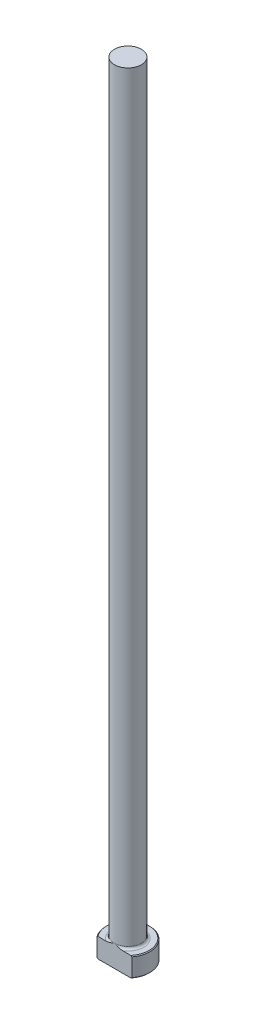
ISO-10303-21;
HEADER;
FILE_DESCRIPTION(('STEP AP214'),'2;1');
FILE_NAME('part.step','',(''),(''),'','','');
FILE_SCHEMA(('AUTOMOTIVE_DESIGN { 1 0 10303 214 1 1 1 1 }'));
ENDSEC;
DATA;
#1=APPLICATION_CONTEXT('core data for automotive mechanical design processes');
#2=APPLICATION_PROTOCOL_DEFINITION('international standard','automotive_design',2000,#1);
#3=PRODUCT_CONTEXT('',#1,'mechanical');
#4=PRODUCT('Part','Part','',(#3));
#5=PRODUCT_RELATED_PRODUCT_CATEGORY('part','',(#4));
#6=PRODUCT_DEFINITION_FORMATION('','',#4);
#7=PRODUCT_DEFINITION_CONTEXT('part definition',#1,'design');
#8=PRODUCT_DEFINITION('design','',#6,#7);
#9=PRODUCT_DEFINITION_SHAPE('','',#8);
#10=(LENGTH_UNIT() NAMED_UNIT(*) SI_UNIT(.MILLI.,.METRE.));
#11=(NAMED_UNIT(*) PLANE_ANGLE_UNIT() SI_UNIT($,.RADIAN.));
#12=(NAMED_UNIT(*) SI_UNIT($,.STERADIAN.) SOLID_ANGLE_UNIT());
#13=UNCERTAINTY_MEASURE_WITH_UNIT(LENGTH_MEASURE(1.E-05),#10,'distance_accuracy_value','');
#14=(GEOMETRIC_REPRESENTATION_CONTEXT(3) GLOBAL_UNCERTAINTY_ASSIGNED_CONTEXT((#13)) GLOBAL_UNIT_ASSIGNED_CONTEXT((#10,
#11,#12)) REPRESENTATION_CONTEXT('',''));
#15=CARTESIAN_POINT('',(0.,0.,0.));
#16=DIRECTION('',(0.,0.,1.));
#17=DIRECTION('',(1.,0.,0.));
#18=AXIS2_PLACEMENT_3D('',#15,#16,#17);
#19=CARTESIAN_POINT('',(0.,0.,0.));
#20=DIRECTION('',(0.,-1.,0.));
#21=DIRECTION('',(0.,0.,-1.));
#22=AXIS2_PLACEMENT_3D('',#19,#20,#21);
#23=PLANE('',#22);
#24=CARTESIAN_POINT('',(0.,0.,0.));
#25=DIRECTION('',(0.,-1.,0.));
#26=DIRECTION('',(0.,0.,-1.));
#27=AXIS2_PLACEMENT_3D('',#24,#25,#26);
#28=CIRCLE('',#27,6.88339999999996);
#29=CARTESIAN_POINT('',(-5.3224109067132,0.,4.36498999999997));
#30=VERTEX_POINT('',#29);
#31=CARTESIAN_POINT('',(5.3224109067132,0.,4.36498999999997));
#32=VERTEX_POINT('',#31);
#33=EDGE_CURVE('E98',#30,#32,#28,.T.);
#34=ORIENTED_EDGE('',*,*,#33,.T.);
#35=DIRECTION('',(-1.,0.,0.));
#36=VECTOR('',#35,1.);
#37=CARTESIAN_POINT('',(-5.64706481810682,0.,4.36498999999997));
#38=LINE('',#37,#36);
#39=EDGE_CURVE('E83',#32,#30,#38,.T.);
#40=ORIENTED_EDGE('',*,*,#39,.T.);
#41=EDGE_LOOP('',(#34,#40));
#42=FACE_BOUND('',#41,.T.);
#43=ADVANCED_FACE('F32',(#42),#23,.T.);
#44=CARTESIAN_POINT('',(0.,259.958771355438,0.));
#45=DIRECTION('',(0.,1.,0.));
#46=DIRECTION('',(0.,0.,1.));
#47=AXIS2_PLACEMENT_3D('',#44,#45,#46);
#48=CYLINDRICAL_SURFACE('',#47,7.13739999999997);
#49=CARTESIAN_POINT('',(0.,6.09599999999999,0.));
#50=DIRECTION('',(0.,1.,0.));
#51=DIRECTION('',(0.,0.,1.));
#52=AXIS2_PLACEMENT_3D('',#49,#50,#51);
#53=CIRCLE('',#52,7.13739999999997);
#54=CARTESIAN_POINT('',(-5.64706481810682,6.09599999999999,4.36498999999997));
#55=VERTEX_POINT('',#54);
#56=CARTESIAN_POINT('',(5.64706481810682,6.09599999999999,4.36498999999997));
#57=VERTEX_POINT('',#56);
#58=EDGE_CURVE('E104',#55,#57,#53,.F.);
#59=ORIENTED_EDGE('',*,*,#58,.T.);
#60=DIRECTION('',(0.,-1.,0.));
#61=VECTOR('',#60,1.);
#62=CARTESIAN_POINT('',(5.64706481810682,254.,4.36498999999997));
#63=LINE('',#62,#61);
#64=CARTESIAN_POINT('',(5.64706481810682,0.253999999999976,4.36498999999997));
#65=VERTEX_POINT('',#64);
#66=EDGE_CURVE('E183',#57,#65,#63,.T.);
#67=ORIENTED_EDGE('',*,*,#66,.T.);
#68=CARTESIAN_POINT('',(0.,0.253999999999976,0.));
#69=DIRECTION('',(0.,-1.,0.));
#70=DIRECTION('',(0.,0.,-1.));
#71=AXIS2_PLACEMENT_3D('',#68,#69,#70);
#72=CIRCLE('',#71,7.13739999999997);
#73=CARTESIAN_POINT('',(-5.64706481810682,0.253999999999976,4.36498999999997));
#74=VERTEX_POINT('',#73);
#75=EDGE_CURVE('E100',#65,#74,#72,.F.);
#76=ORIENTED_EDGE('',*,*,#75,.T.);
#77=DIRECTION('',(0.,-1.,0.));
#78=VECTOR('',#77,1.);
#79=CARTESIAN_POINT('',(-5.64706481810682,254.,4.36498999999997));
#80=LINE('',#79,#78);
#81=EDGE_CURVE('E93',#55,#74,#80,.T.);
#82=ORIENTED_EDGE('',*,*,#81,.F.);
#83=EDGE_LOOP('',(#59,#67,#76,#82));
#84=FACE_BOUND('',#83,.T.);
#85=ADVANCED_FACE('F158',(#84),#48,.T.);
#86=CARTESIAN_POINT('',(-7.13739999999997,6.35,0.));
#87=DIRECTION('',(0.,1.,0.));
#88=DIRECTION('',(0.,0.,1.));
#89=AXIS2_PLACEMENT_3D('',#86,#87,#88);
#90=PLANE('',#89);
#91=CARTESIAN_POINT('',(0.,6.35,0.));
#92=DIRECTION('',(0.,1.,0.));
#93=DIRECTION('',(0.,0.,1.));
#94=AXIS2_PLACEMENT_3D('',#91,#92,#93);
#95=CIRCLE('',#94,6.88340000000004);
#96=CARTESIAN_POINT('',(5.32241090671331,6.35,4.36498999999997));
#97=VERTEX_POINT('',#96);
#98=CARTESIAN_POINT('',(-5.32241090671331,6.35,4.36498999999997));
#99=VERTEX_POINT('',#98);
#100=EDGE_CURVE('E178',#97,#99,#95,.T.);
#101=ORIENTED_EDGE('',*,*,#100,.T.);
#102=DIRECTION('',(1.,0.,0.));
#103=VECTOR('',#102,1.);
#104=CARTESIAN_POINT('',(-7.13739999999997,6.35,4.36498999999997));
#105=LINE('',#104,#103);
#106=CARTESIAN_POINT('',(-2.68940304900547,6.35000000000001,4.36498999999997));
#107=VERTEX_POINT('',#106);
#108=EDGE_CURVE('E57',#99,#107,#105,.T.);
#109=ORIENTED_EDGE('',*,*,#108,.T.);
#110=CARTESIAN_POINT('',(0.,6.35,0.));
#111=DIRECTION('',(0.,1.,0.));
#112=DIRECTION('',(0.,0.,1.));
#113=AXIS2_PLACEMENT_3D('',#110,#111,#112);
#114=CIRCLE('',#113,5.12698999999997);
#115=CARTESIAN_POINT('',(2.68940304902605,6.35000000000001,4.36498999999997));
#116=VERTEX_POINT('',#115);
#117=EDGE_CURVE('E107',#107,#116,#114,.F.);
#118=ORIENTED_EDGE('',*,*,#117,.T.);
#119=EDGE_CURVE('E136',#116,#97,#105,.T.);
#120=ORIENTED_EDGE('',*,*,#119,.T.);
#121=EDGE_LOOP('',(#101,#109,#118,#120));
#122=FACE_BOUND('',#121,.T.);
#123=ADVANCED_FACE('F147',(#122),#90,.T.);
#124=CARTESIAN_POINT('',(0.,6.35000000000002,0.));
#125=DIRECTION('',(0.,-1.,0.));
#126=DIRECTION('',(0.,0.,-1.));
#127=AXIS2_PLACEMENT_3D('',#124,#125,#126);
#128=CONICAL_SURFACE('',#127,6.88340000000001,0.785398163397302);
#129=ORIENTED_EDGE('',*,*,#58,.F.);
#130=CARTESIAN_POINT('',(-12.4254560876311,0.0635443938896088,4.36498999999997));
#131=CARTESIAN_POINT('',(-12.2264754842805,0.251274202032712,4.36498999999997));
#132=CARTESIAN_POINT('',(-12.027251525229,0.438746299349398,4.36498999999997));
#133=CARTESIAN_POINT('',(-11.6282346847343,0.813086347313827,4.36498999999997));
#134=CARTESIAN_POINT('',(-11.4284417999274,0.999954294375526,4.36498999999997));
#135=CARTESIAN_POINT('',(-10.8277329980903,1.55984821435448,4.36498999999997));
#136=CARTESIAN_POINT('',(-10.4258415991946,1.93182905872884,4.36498999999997));
#137=CARTESIAN_POINT('',(-9.6054098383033,2.68403168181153,4.36498999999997));
#138=CARTESIAN_POINT('',(-9.18675348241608,3.06412737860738,4.36498999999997));
#139=CARTESIAN_POINT('',(-8.5549523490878,3.62966956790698,4.36498999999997));
#140=CARTESIAN_POINT('',(-8.34380112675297,3.81734255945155,4.36498999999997));
#141=CARTESIAN_POINT('',(-7.91988421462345,4.19085479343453,4.36498999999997));
#142=CARTESIAN_POINT('',(-7.70711853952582,4.37669405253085,4.36498999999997));
#143=CARTESIAN_POINT('',(-7.27981523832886,4.74592147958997,4.36498999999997));
#144=CARTESIAN_POINT('',(-7.06527945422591,4.92931177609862,4.36498999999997));
#145=CARTESIAN_POINT('',(-6.63376365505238,5.29321745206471,4.36498999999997));
#146=CARTESIAN_POINT('',(-6.41678354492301,5.47373271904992,4.36498999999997));
#147=CARTESIAN_POINT('',(-5.9791971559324,5.83150772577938,4.36498999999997));
#148=CARTESIAN_POINT('',(-5.75858285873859,6.00875768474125,4.36498999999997));
#149=CARTESIAN_POINT('',(-5.31347514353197,6.35828986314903,4.36498999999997));
#150=CARTESIAN_POINT('',(-5.08898216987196,6.53057264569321,4.36498999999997));
#151=CARTESIAN_POINT('',(-4.6382365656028,6.86598134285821,4.36498999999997));
#152=CARTESIAN_POINT('',(-4.41205572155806,7.02920333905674,4.36498999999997));
#153=CARTESIAN_POINT('',(-3.95321518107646,7.34667825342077,4.36498999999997));
#154=CARTESIAN_POINT('',(-3.72055201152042,7.50092622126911,4.36498999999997));
#155=CARTESIAN_POINT('',(-3.36592178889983,7.72212517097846,4.36498999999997));
#156=CARTESIAN_POINT('',(-3.24703751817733,7.79401703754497,4.36498999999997));
#157=CARTESIAN_POINT('',(-3.00696415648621,7.93383106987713,4.36498999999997));
#158=CARTESIAN_POINT('',(-2.88577534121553,8.00175370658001,4.36498999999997));
#159=CARTESIAN_POINT('',(-2.64094314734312,8.1327102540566,4.36498999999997));
#160=CARTESIAN_POINT('',(-2.51730263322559,8.19574949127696,4.36498999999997));
#161=CARTESIAN_POINT('',(-2.26721111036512,8.31594515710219,4.36498999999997));
#162=CARTESIAN_POINT('',(-2.14076077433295,8.37310297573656,4.36498999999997));
#163=CARTESIAN_POINT('',(-1.88226589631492,8.48134616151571,4.36498999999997));
#164=CARTESIAN_POINT('',(-1.75015999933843,8.53228640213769,4.36498999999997));
#165=CARTESIAN_POINT('',(-1.48274649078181,8.62515083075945,4.36498999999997));
#166=CARTESIAN_POINT('',(-1.34743816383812,8.66707298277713,4.36498999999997));
#167=CARTESIAN_POINT('',(-1.07468401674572,8.73996841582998,4.36498999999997));
#168=CARTESIAN_POINT('',(-0.937254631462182,8.77100233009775,4.36498999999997));
#169=CARTESIAN_POINT('',(-0.660180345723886,8.82086954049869,4.36498999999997));
#170=CARTESIAN_POINT('',(-0.520535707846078,8.83970427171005,4.36498999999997));
#171=CARTESIAN_POINT('',(-0.238572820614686,8.86417414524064,4.36498999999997));
#172=CARTESIAN_POINT('',(-0.0962419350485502,8.86966662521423,4.36498999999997));
#173=CARTESIAN_POINT('',(0.188262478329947,8.86666840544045,4.36498999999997));
#174=CARTESIAN_POINT('',(0.330436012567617,8.85817829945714,4.36498999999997));
#175=CARTESIAN_POINT('',(0.61388232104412,8.82771699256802,4.36498999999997));
#176=CARTESIAN_POINT('',(0.755149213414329,8.80569197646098,4.36498999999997));
#177=CARTESIAN_POINT('',(1.03521985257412,8.74943185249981,4.36498999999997));
#178=CARTESIAN_POINT('',(1.17402294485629,8.71519354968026,4.36498999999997));
#179=CARTESIAN_POINT('',(1.51066758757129,8.61833915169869,4.36498999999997));
#180=CARTESIAN_POINT('',(1.70682320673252,8.54989183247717,4.36498999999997));
#181=CARTESIAN_POINT('',(2.09235587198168,8.3960724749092,4.36498999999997));
#182=CARTESIAN_POINT('',(2.28172826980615,8.31068908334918,4.36498999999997));
#183=CARTESIAN_POINT('',(2.56204757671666,8.17271353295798,4.36498999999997));
#184=CARTESIAN_POINT('',(2.65534447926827,8.12479314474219,4.36498999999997));
#185=CARTESIAN_POINT('',(2.84046183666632,8.02617252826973,4.36498999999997));
#186=CARTESIAN_POINT('',(2.93228227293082,7.97547226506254,4.36498999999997));
#187=CARTESIAN_POINT('',(3.1145205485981,7.87170555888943,4.36498999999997));
#188=CARTESIAN_POINT('',(3.20493895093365,7.81864010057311,4.36498999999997));
#189=CARTESIAN_POINT('',(3.38452391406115,7.71044662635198,4.36498999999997));
#190=CARTESIAN_POINT('',(3.473690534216,7.65531870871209,4.36498999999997));
#191=CARTESIAN_POINT('',(3.77921712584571,7.46215440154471,4.36498999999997));
#192=CARTESIAN_POINT('',(3.9927694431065,7.31966964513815,4.36498999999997));
#193=CARTESIAN_POINT('',(4.41459089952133,7.02705367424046,4.36498999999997));
#194=CARTESIAN_POINT('',(4.62285858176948,6.87692038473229,4.36498999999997));
#195=CARTESIAN_POINT('',(5.035388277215,6.5708826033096,4.36498999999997));
#196=CARTESIAN_POINT('',(5.23964647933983,6.41497299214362,4.36498999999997));
#197=CARTESIAN_POINT('',(5.64480634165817,6.09891103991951,4.36498999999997));
#198=CARTESIAN_POINT('',(5.84570833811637,5.93875912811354,4.36498999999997));
#199=CARTESIAN_POINT('',(6.24560426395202,5.61454392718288,4.36498999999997));
#200=CARTESIAN_POINT('',(6.44458790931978,5.45046798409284,4.36498999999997));
#201=CARTESIAN_POINT('',(6.84037485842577,5.11970386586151,4.36498999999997));
#202=CARTESIAN_POINT('',(7.03717811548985,4.9530156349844,4.36498999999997));
#203=CARTESIAN_POINT('',(7.42889322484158,4.61763773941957,4.36498999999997));
#204=CARTESIAN_POINT('',(7.62380600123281,4.44894915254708,4.36498999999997));
#205=CARTESIAN_POINT('',(8.01214949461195,4.10987343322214,4.36498999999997));
#206=CARTESIAN_POINT('',(8.20558019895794,3.9394862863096,4.36498999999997));
#207=CARTESIAN_POINT('',(8.7407707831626,3.46461406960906,4.36498999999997));
#208=CARTESIAN_POINT('',(9.08120180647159,3.15863169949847,4.36498999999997));
#209=CARTESIAN_POINT('',(9.75921761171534,2.54343968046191,4.36498999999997));
#210=CARTESIAN_POINT('',(10.096801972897,2.23422956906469,4.36498999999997));
#211=CARTESIAN_POINT('',(10.7672168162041,1.61576625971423,4.36498999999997));
#212=CARTESIAN_POINT('',(11.1000639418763,1.30653108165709,4.36498999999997));
#213=CARTESIAN_POINT('',(11.763971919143,0.686268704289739,4.36498999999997));
#214=CARTESIAN_POINT('',(12.0950330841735,0.375241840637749,4.36498999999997));
#215=CARTESIAN_POINT('',(12.4254560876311,0.0635443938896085,4.36498999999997));
#216=B_SPLINE_CURVE_WITH_KNOTS('',3,(#130,#131,#132,#133,#134,#135,#136,#137,#138,#139,#140,
#141,#142,#143,#144,#145,#146,#147,#148,#149,#150,#151,#152,#153,#154,#155,#156,#157,#158,#159,
#160,#161,#162,#163,#164,#165,#166,#167,#168,#169,#170,#171,#172,#173,#174,#175,#176,#177,#178,
#179,#180,#181,#182,#183,#184,#185,#186,#187,#188,#189,#190,#191,#192,#193,#194,#195,#196,#197,
#198,#199,#200,#201,#202,#203,#204,#205,#206,#207,#208,#209,#210,#211,#212,#213,#214,#215),
.UNSPECIFIED.,.F.,.F.,(4,2,2,2,2,2,2,2,2,2,2,2,2,2,2,2,2,2,2,2,2,2,2,2,2,2,2,2,2,2,2,2,2,2,2,2,
2,2,2,2,2,2,4),(0.,0.82068365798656,1.64137217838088,3.28421321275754,4.98055028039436,
5.82804083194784,6.67552367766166,7.52221443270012,8.36893822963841,9.21788289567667,
10.066730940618,10.9033662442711,11.7404587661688,12.157193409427,12.5738785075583,
12.9901025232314,13.4062279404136,13.8307163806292,14.2553005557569,14.6774813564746,
15.0996124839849,15.5262377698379,15.9528449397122,16.3811593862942,16.8095859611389,
17.4317469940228,18.0543265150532,18.3689414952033,18.6835604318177,18.9980495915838,
19.3125237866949,20.0824228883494,20.8525319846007,21.6233407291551,22.3940717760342,
23.167761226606,23.941467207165,24.7147737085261,25.4880867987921,26.8612512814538,
28.2346152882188,29.597590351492,30.9603178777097),.UNSPECIFIED.);
#217=EDGE_CURVE('E135',#55,#99,#216,.T.);
#218=ORIENTED_EDGE('',*,*,#217,.T.);
#219=ORIENTED_EDGE('',*,*,#100,.F.);
#220=EDGE_CURVE('E127',#97,#57,#216,.T.);
#221=ORIENTED_EDGE('',*,*,#220,.T.);
#222=EDGE_LOOP('',(#129,#218,#219,#221));
#223=FACE_BOUND('',#222,.T.);
#224=ADVANCED_FACE('F143',(#223),#128,.T.);
#225=CARTESIAN_POINT('',(0.,0.253999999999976,0.));
#226=DIRECTION('',(0.,1.,0.));
#227=DIRECTION('',(0.,0.,1.));
#228=AXIS2_PLACEMENT_3D('',#225,#226,#227);
#229=CONICAL_SURFACE('',#228,7.13739999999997,0.78539816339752);
#230=ORIENTED_EDGE('',*,*,#75,.F.);
#231=CARTESIAN_POINT('',(12.4254560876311,6.28645560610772,4.36498999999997));
#232=CARTESIAN_POINT('',(12.2264754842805,6.09872579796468,4.36498999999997));
#233=CARTESIAN_POINT('',(12.027251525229,5.91125370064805,4.36498999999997));
#234=CARTESIAN_POINT('',(11.6282346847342,5.53691365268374,4.36498999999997));
#235=CARTESIAN_POINT('',(11.4284417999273,5.3500457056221,4.36498999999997));
#236=CARTESIAN_POINT('',(10.8277329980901,4.79015178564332,4.36498999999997));
#237=CARTESIAN_POINT('',(10.4258415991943,4.41817094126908,4.36498999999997));
#238=CARTESIAN_POINT('',(9.60540983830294,3.66596831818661,4.36498999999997));
#239=CARTESIAN_POINT('',(9.18675348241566,3.28587262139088,4.36498999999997));
#240=CARTESIAN_POINT('',(8.55495234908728,2.72033043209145,4.36498999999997));
#241=CARTESIAN_POINT('',(8.34380112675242,2.53265744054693,4.36498999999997));
#242=CARTESIAN_POINT('',(7.91988421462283,2.15914520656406,4.36498999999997));
#243=CARTESIAN_POINT('',(7.70711853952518,1.9733059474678,4.36498999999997));
#244=CARTESIAN_POINT('',(7.27981523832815,1.6040785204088,4.36498999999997));
#245=CARTESIAN_POINT('',(7.06527945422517,1.4206882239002,4.36498999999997));
#246=CARTESIAN_POINT('',(6.63376365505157,1.05678254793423,4.36498999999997));
#247=CARTESIAN_POINT('',(6.41678354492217,0.876267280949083,4.36498999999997));
#248=CARTESIAN_POINT('',(5.9791971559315,0.518492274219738,4.36498999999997));
#249=CARTESIAN_POINT('',(5.75858285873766,0.341242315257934,4.36498999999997));
#250=CARTESIAN_POINT('',(5.31347514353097,-0.00828986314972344,4.36498999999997));
#251=CARTESIAN_POINT('',(5.08898216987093,-0.180572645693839,4.36498999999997));
#252=CARTESIAN_POINT('',(4.63823656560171,-0.5159813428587,4.36498999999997));
#253=CARTESIAN_POINT('',(4.41205572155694,-0.679203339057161,4.36498999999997));
#254=CARTESIAN_POINT('',(3.95321518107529,-0.996678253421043,4.36498999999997));
#255=CARTESIAN_POINT('',(3.72055201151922,-1.15092622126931,4.36498999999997));
#256=CARTESIAN_POINT('',(3.36592178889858,-1.37212517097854,4.36498999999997));
#257=CARTESIAN_POINT('',(3.24703751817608,-1.44401703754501,4.36498999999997));
#258=CARTESIAN_POINT('',(3.00696415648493,-1.58383106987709,4.36498999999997));
#259=CARTESIAN_POINT('',(2.88577534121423,-1.65175370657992,4.36498999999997));
#260=CARTESIAN_POINT('',(2.6409431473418,-1.78271025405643,4.36498999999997));
#261=CARTESIAN_POINT('',(2.51730263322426,-1.84574949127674,4.36498999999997));
#262=CARTESIAN_POINT('',(2.26721111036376,-1.96594515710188,4.36498999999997));
#263=CARTESIAN_POINT('',(2.14076077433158,-2.0231029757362,4.36498999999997));
#264=CARTESIAN_POINT('',(1.88226589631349,-2.13134616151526,4.36498999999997));
#265=CARTESIAN_POINT('',(1.75015999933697,-2.1822864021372,4.36498999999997));
#266=CARTESIAN_POINT('',(1.48274649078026,-2.27515083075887,4.36498999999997));
#267=CARTESIAN_POINT('',(1.34743816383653,-2.31707298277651,4.36498999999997));
#268=CARTESIAN_POINT('',(1.07468401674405,-2.38996841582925,4.36498999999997));
#269=CARTESIAN_POINT('',(0.937254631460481,-2.42100233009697,4.36498999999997));
#270=CARTESIAN_POINT('',(0.660180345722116,-2.4708695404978,4.36498999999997));
#271=CARTESIAN_POINT('',(0.520535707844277,-2.4897042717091,4.36498999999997));
#272=CARTESIAN_POINT('',(0.238572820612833,-2.51417414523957,4.36498999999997));
#273=CARTESIAN_POINT('',(0.0962419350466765,-2.51966662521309,4.36498999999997));
#274=CARTESIAN_POINT('',(-0.188262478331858,-2.51666840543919,4.36498999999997));
#275=CARTESIAN_POINT('',(-0.330436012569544,-2.50817829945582,4.36498999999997));
#276=CARTESIAN_POINT('',(-0.613882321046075,-2.47771699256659,4.36498999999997));
#277=CARTESIAN_POINT('',(-0.755149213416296,-2.45569197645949,4.36498999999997));
#278=CARTESIAN_POINT('',(-1.03521985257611,-2.39943185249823,4.36498999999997));
#279=CARTESIAN_POINT('',(-1.17402294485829,-2.36519354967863,4.36498999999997));
#280=CARTESIAN_POINT('',(-1.51066758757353,-2.26833915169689,4.36498999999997));
#281=CARTESIAN_POINT('',(-1.706823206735,-2.19989183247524,4.36498999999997));
#282=CARTESIAN_POINT('',(-2.09235587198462,-2.04607247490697,4.36498999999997));
#283=CARTESIAN_POINT('',(-2.28172826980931,-1.96068908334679,4.36498999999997));
#284=CARTESIAN_POINT('',(-2.56204757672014,-1.82271353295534,4.36498999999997));
#285=CARTESIAN_POINT('',(-2.65534447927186,-1.77479314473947,4.36498999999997));
#286=CARTESIAN_POINT('',(-2.84046183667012,-1.67617252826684,4.36498999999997));
#287=CARTESIAN_POINT('',(-2.93228227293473,-1.62547226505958,4.36498999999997));
#288=CARTESIAN_POINT('',(-3.11452054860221,-1.52170555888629,4.36498999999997));
#289=CARTESIAN_POINT('',(-3.20493895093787,-1.46864010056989,4.36498999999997));
#290=CARTESIAN_POINT('',(-3.38452391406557,-1.36044662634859,4.36498999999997));
#291=CARTESIAN_POINT('',(-3.47369053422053,-1.30531870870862,4.36498999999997));
#292=CARTESIAN_POINT('',(-3.77921712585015,-1.11215440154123,4.36498999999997));
#293=CARTESIAN_POINT('',(-3.99276944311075,-0.969669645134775,4.36498999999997));
#294=CARTESIAN_POINT('',(-4.41459089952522,-0.67705367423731,4.36498999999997));
#295=CARTESIAN_POINT('',(-4.62285858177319,-0.526920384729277,4.36498999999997));
#296=CARTESIAN_POINT('',(-5.03538827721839,-0.22088260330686,4.36498999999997));
#297=CARTESIAN_POINT('',(-5.23964647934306,-0.0649729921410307,4.36498999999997));
#298=CARTESIAN_POINT('',(-5.6448063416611,0.251088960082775,4.36498999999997));
#299=CARTESIAN_POINT('',(-5.84570833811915,0.411240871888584,4.36498999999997));
#300=CARTESIAN_POINT('',(-6.24560426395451,0.735456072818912,4.36498999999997));
#301=CARTESIAN_POINT('',(-6.44458790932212,0.899532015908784,4.36498999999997));
#302=CARTESIAN_POINT('',(-6.84037485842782,1.23029613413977,4.36498999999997));
#303=CARTESIAN_POINT('',(-7.03717811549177,1.3969843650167,4.36498999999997));
#304=CARTESIAN_POINT('',(-7.42889322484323,1.73236226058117,4.36498999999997));
#305=CARTESIAN_POINT('',(-7.62380600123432,1.90105084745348,4.36498999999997));
#306=CARTESIAN_POINT('',(-8.0121494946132,2.24012656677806,4.36498999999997));
#307=CARTESIAN_POINT('',(-8.20558019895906,2.41051371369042,4.36498999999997));
#308=CARTESIAN_POINT('',(-8.7407707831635,2.88538593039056,4.36498999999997));
#309=CARTESIAN_POINT('',(-9.08120180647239,3.19136830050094,4.36498999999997));
#310=CARTESIAN_POINT('',(-9.75921761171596,3.80656031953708,4.36498999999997));
#311=CARTESIAN_POINT('',(-10.0968019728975,4.11577043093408,4.36498999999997));
#312=CARTESIAN_POINT('',(-10.7672168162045,4.73423374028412,4.36498999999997));
#313=CARTESIAN_POINT('',(-11.1000639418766,5.04346891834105,4.36498999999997));
#314=CARTESIAN_POINT('',(-11.7639719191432,5.663731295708,4.36498999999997));
#315=CARTESIAN_POINT('',(-12.0950330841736,5.97475815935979,4.36498999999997));
#316=CARTESIAN_POINT('',(-12.4254560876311,6.28645560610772,4.36498999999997));
#317=B_SPLINE_CURVE_WITH_KNOTS('',3,(#231,#232,#233,#234,#235,#236,#237,#238,#239,#240,#241,
#242,#243,#244,#245,#246,#247,#248,#249,#250,#251,#252,#253,#254,#255,#256,#257,#258,#259,#260,
#261,#262,#263,#264,#265,#266,#267,#268,#269,#270,#271,#272,#273,#274,#275,#276,#277,#278,#279,
#280,#281,#282,#283,#284,#285,#286,#287,#288,#289,#290,#291,#292,#293,#294,#295,#296,#297,#298,
#299,#300,#301,#302,#303,#304,#305,#306,#307,#308,#309,#310,#311,#312,#313,#314,#315,#316),
.UNSPECIFIED.,.F.,.F.,(4,2,2,2,2,2,2,2,2,2,2,2,2,2,2,2,2,2,2,2,2,2,2,2,2,2,2,2,2,2,2,2,2,2,2,2,
2,2,2,2,2,2,4),(0.,0.820683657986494,1.64137217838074,3.28421321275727,4.98055028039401,
5.82804083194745,6.67552367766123,7.52221443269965,8.3689382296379,9.21788289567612,
10.0667309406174,10.9033662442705,11.7404587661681,12.1571934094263,12.5738785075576,
12.9901025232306,13.4062279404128,13.8307163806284,14.2553005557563,14.677481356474,
15.0996124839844,15.5262377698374,15.9528449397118,16.3811593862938,16.8095859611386,
17.4317469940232,18.0543265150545,18.368941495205,18.6835604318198,18.9980495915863,
19.3125237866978,20.0824228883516,20.8525319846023,21.6233407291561,22.3940717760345,
23.1677612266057,23.941467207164,24.7147737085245,25.4880867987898,26.8612512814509,
28.2346152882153,29.5975903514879,30.960317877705),.UNSPECIFIED.);
#318=EDGE_CURVE('E86',#65,#32,#317,.T.);
#319=ORIENTED_EDGE('',*,*,#318,.T.);
#320=ORIENTED_EDGE('',*,*,#33,.F.);
#321=EDGE_CURVE('E89',#30,#74,#317,.T.);
#322=ORIENTED_EDGE('',*,*,#321,.T.);
#323=EDGE_LOOP('',(#230,#319,#320,#322));
#324=FACE_BOUND('',#323,.T.);
#325=ADVANCED_FACE('F97',(#324),#229,.T.);
#326=CARTESIAN_POINT('',(0.,7.11200000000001,0.));
#327=DIRECTION('',(0.,1.,0.));
#328=DIRECTION('',(0.,0.,1.));
#329=AXIS2_PLACEMENT_3D('',#326,#327,#328);
#330=TOROIDAL_SURFACE('',#329,5.12698999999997,0.762);
#331=CARTESIAN_POINT('',(0.,7.11200000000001,4.36498999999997));
#332=CARTESIAN_POINT('',(1.978186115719E-11,7.11200099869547,4.36498999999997));
#333=CARTESIAN_POINT('',(1.99998569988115E-07,7.11200199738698,4.36498999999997));
#334=CARTESIAN_POINT('',(8.39708111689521E-07,7.11200392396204,4.36498999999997));
#335=CARTESIAN_POINT('',(1.28513797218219E-06,7.11200484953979,4.36498999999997));
#336=CARTESIAN_POINT('',(2.35714654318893E-06,7.11200669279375,4.36498999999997));
#337=CARTESIAN_POINT('',(2.99576916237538E-06,7.11200760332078,4.36498999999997));
#338=CARTESIAN_POINT('',(4.37706148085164E-06,7.1120093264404,4.36498999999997));
#339=CARTESIAN_POINT('',(5.11891983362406E-06,7.11201013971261,4.36498999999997));
#340=CARTESIAN_POINT('',(7.76598241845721E-06,7.11201284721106,4.36498999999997));
#341=CARTESIAN_POINT('',(9.80707323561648E-06,7.11201461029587,4.36498999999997));
#342=CARTESIAN_POINT('',(1.40385710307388E-05,7.11201776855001,4.36498999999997));
#343=CARTESIAN_POINT('',(1.62217218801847E-05,7.1120191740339,4.36498999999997));
#344=CARTESIAN_POINT('',(2.46880925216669E-05,7.11202440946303,4.36498999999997));
#345=CARTESIAN_POINT('',(3.11510761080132E-05,7.11202796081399,4.36498999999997));
#346=CARTESIAN_POINT('',(4.39385738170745E-05,7.11203381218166,4.36498999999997));
#347=CARTESIAN_POINT('',(5.02270954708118E-05,7.11203619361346,4.36498999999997));
#348=CARTESIAN_POINT('',(7.68671397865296E-05,7.11204623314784,4.36498999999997));
#349=CARTESIAN_POINT('',(9.7243194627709E-05,7.11205379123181,4.36498999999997));
#350=CARTESIAN_POINT('',(0.000135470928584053,7.11206600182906,4.36498999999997));
#351=CARTESIAN_POINT('',(0.00015323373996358,7.11207092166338,4.36498999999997));
#352=CARTESIAN_POINT('',(0.000281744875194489,7.11210968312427,4.36498999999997));
#353=CARTESIAN_POINT('',(0.000387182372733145,7.11215881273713,4.36498999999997));
#354=CARTESIAN_POINT('',(0.0007963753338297,7.11234245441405,4.36498999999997));
#355=CARTESIAN_POINT('',(0.0011038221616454,7.11246560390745,4.36498999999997));
#356=CARTESIAN_POINT('',(0.00229468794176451,7.11294975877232,4.36498999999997));
#357=CARTESIAN_POINT('',(0.00317431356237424,7.11332268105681,4.36498999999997));
#358=CARTESIAN_POINT('',(0.00676396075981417,7.11483719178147,4.36498999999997));
#359=CARTESIAN_POINT('',(0.00947818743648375,7.11596530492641,4.36498999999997));
#360=CARTESIAN_POINT('',(0.0441052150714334,7.13036680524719,4.36498999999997));
#361=CARTESIAN_POINT('',(0.0759900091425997,7.14373054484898,4.36498999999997));
#362=CARTESIAN_POINT('',(0.140245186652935,7.17056976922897,4.36498999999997));
#363=CARTESIAN_POINT('',(0.172615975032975,7.18404410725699,4.36498999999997));
#364=CARTESIAN_POINT('',(0.266939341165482,7.2232177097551,4.36498999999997));
#365=CARTESIAN_POINT('',(0.328921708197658,7.2488485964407,4.36498999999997));
#366=CARTESIAN_POINT('',(0.460259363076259,7.30262060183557,4.36498999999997));
#367=CARTESIAN_POINT('',(0.529636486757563,7.33070831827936,4.36498999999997));
#368=CARTESIAN_POINT('',(0.669424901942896,7.38634205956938,4.36498999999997));
#369=CARTESIAN_POINT('',(0.739839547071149,7.41387970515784,4.36498999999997));
#370=CARTESIAN_POINT('',(0.862842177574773,7.46081950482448,4.36498999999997));
#371=CARTESIAN_POINT('',(0.915329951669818,7.48048352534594,4.36498999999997));
#372=CARTESIAN_POINT('',(1.02046271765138,7.51898724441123,4.36498999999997));
#373=CARTESIAN_POINT('',(1.07310702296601,7.53782882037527,4.36498999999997));
#374=CARTESIAN_POINT('',(1.22921061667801,7.59217247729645,4.36498999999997));
#375=CARTESIAN_POINT('',(1.33312863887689,7.6263793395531,4.36498999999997));
#376=CARTESIAN_POINT('',(1.53643041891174,7.68824550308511,4.36498999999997));
#377=CARTESIAN_POINT('',(1.63573333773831,7.71616747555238,4.36498999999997));
#378=CARTESIAN_POINT('',(1.83640023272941,7.76677412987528,4.36498999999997));
#379=CARTESIAN_POINT('',(1.93777359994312,7.78942216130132,4.36498999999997));
#380=CARTESIAN_POINT('',(2.14806985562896,7.8289052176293,4.36498999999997));
#381=CARTESIAN_POINT('',(2.25707764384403,7.84530422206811,4.36498999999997));
#382=CARTESIAN_POINT('',(2.47588714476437,7.8679551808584,4.36498999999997));
#383=CARTESIAN_POINT('',(2.58568573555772,7.8742357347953,4.36498999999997));
#384=CARTESIAN_POINT('',(2.80336826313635,7.87375511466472,4.36498999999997));
#385=CARTESIAN_POINT('',(2.91124890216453,7.8672396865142,4.36498999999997));
#386=CARTESIAN_POINT('',(3.07062418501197,7.84522848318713,4.36498999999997));
#387=CARTESIAN_POINT('',(3.12298608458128,7.83595753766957,4.36498999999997));
#388=CARTESIAN_POINT('',(3.22666070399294,7.81280437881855,4.36498999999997));
#389=CARTESIAN_POINT('',(3.27797430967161,7.79892624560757,4.36498999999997));
#390=CARTESIAN_POINT('',(3.38017940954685,7.76544111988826,4.36498999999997));
#391=CARTESIAN_POINT('',(3.43102695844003,7.7456973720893,4.36498999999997));
#392=CARTESIAN_POINT('',(3.52988459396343,7.69970911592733,4.36498999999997));
#393=CARTESIAN_POINT('',(3.57788972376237,7.67345364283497,4.36498999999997));
#394=CARTESIAN_POINT('',(3.66130804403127,7.61871950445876,4.36498999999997));
#395=CARTESIAN_POINT('',(3.69746927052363,7.59139302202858,4.36498999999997));
#396=CARTESIAN_POINT('',(3.76496315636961,7.53131589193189,4.36498999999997));
#397=CARTESIAN_POINT('',(3.79630619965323,7.49857723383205,4.36498999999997));
#398=CARTESIAN_POINT('',(3.84495128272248,7.43683881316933,4.36498999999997));
#399=CARTESIAN_POINT('',(3.86378946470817,7.40905436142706,4.36498999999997));
#400=CARTESIAN_POINT('',(3.89672638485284,7.35078028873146,4.36498999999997));
#401=CARTESIAN_POINT('',(3.91082770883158,7.32029215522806,4.36498999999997));
#402=CARTESIAN_POINT('',(3.93341223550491,7.25699125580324,4.36498999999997));
#403=CARTESIAN_POINT('',(3.94184931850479,7.22416175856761,4.36498999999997));
#404=CARTESIAN_POINT('',(3.95218231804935,7.15748848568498,4.36498999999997));
#405=CARTESIAN_POINT('',(3.95408288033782,7.12364544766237,4.36498999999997));
#406=CARTESIAN_POINT('',(3.95136441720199,7.06046973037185,4.36498999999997));
#407=CARTESIAN_POINT('',(3.9475277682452,7.0311001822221,4.36498999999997));
#408=CARTESIAN_POINT('',(3.93500297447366,6.97342339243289,4.36498999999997));
#409=CARTESIAN_POINT('',(3.92631446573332,6.94511623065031,4.36498999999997));
#410=CARTESIAN_POINT('',(3.90455033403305,6.89001086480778,4.36498999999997));
#411=CARTESIAN_POINT('',(3.89144136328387,6.86322599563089,4.36498999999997));
#412=CARTESIAN_POINT('',(3.86154779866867,6.81181251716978,4.36498999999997));
#413=CARTESIAN_POINT('',(3.84476178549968,6.78718474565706,4.36498999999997));
#414=CARTESIAN_POINT('',(3.79878996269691,6.7282136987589,4.36498999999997));
#415=CARTESIAN_POINT('',(3.76766438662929,6.69537977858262,4.36498999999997));
#416=CARTESIAN_POINT('',(3.70055719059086,6.63508686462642,4.36498999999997));
#417=CARTESIAN_POINT('',(3.66456200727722,6.6076434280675,4.36498999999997));
#418=CARTESIAN_POINT('',(3.57073436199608,6.54553586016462,4.36498999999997));
#419=CARTESIAN_POINT('',(3.51086920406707,6.51395945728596,4.36498999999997));
#420=CARTESIAN_POINT('',(3.38720496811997,6.46043181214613,4.36498999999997));
#421=CARTESIAN_POINT('',(3.32340792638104,6.43847563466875,4.36498999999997));
#422=CARTESIAN_POINT('',(3.20476663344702,6.40562206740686,4.36498999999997));
#423=CARTESIAN_POINT('',(3.1502567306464,6.39347570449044,4.36498999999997));
#424=CARTESIAN_POINT('',(3.04037476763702,6.37391844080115,4.36498999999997));
#425=CARTESIAN_POINT('',(2.9850020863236,6.36651112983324,4.36498999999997));
#426=CARTESIAN_POINT('',(2.81676792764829,6.35028316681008,4.36498999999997));
#427=CARTESIAN_POINT('',(2.70328636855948,6.3478280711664,4.36498999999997));
#428=CARTESIAN_POINT('',(2.47743093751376,6.35562327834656,4.36498999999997));
#429=CARTESIAN_POINT('',(2.36505442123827,6.36582075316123,4.36498999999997));
#430=CARTESIAN_POINT('',(2.14134717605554,6.39595595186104,4.36498999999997));
#431=CARTESIAN_POINT('',(2.03002022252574,6.41592067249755,4.36498999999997));
#432=CARTESIAN_POINT('',(1.81574268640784,6.46192564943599,4.36498999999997));
#433=CARTESIAN_POINT('',(1.71269400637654,6.48752328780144,4.36498999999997));
#434=CARTESIAN_POINT('',(1.5087524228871,6.54368522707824,4.36498999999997));
#435=CARTESIAN_POINT('',(1.40784949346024,6.57421361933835,4.36498999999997));
#436=CARTESIAN_POINT('',(1.21296099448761,6.63733902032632,4.36498999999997));
#437=CARTESIAN_POINT('',(1.11890560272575,6.66972305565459,4.36498999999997));
#438=CARTESIAN_POINT('',(0.977477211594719,6.72063405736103,4.36498999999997));
#439=CARTESIAN_POINT('',(0.929753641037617,6.73819873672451,4.36498999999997));
#440=CARTESIAN_POINT('',(0.834408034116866,6.77394896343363,4.36498999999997));
#441=CARTESIAN_POINT('',(0.786786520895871,6.79213590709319,4.36498999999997));
#442=CARTESIAN_POINT('',(0.675011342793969,6.83546784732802,4.36498999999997));
#443=CARTESIAN_POINT('',(0.610934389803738,6.86081017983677,4.36498999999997));
#444=CARTESIAN_POINT('',(0.483679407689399,6.91188188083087,4.36498999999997));
#445=CARTESIAN_POINT('',(0.42049880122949,6.93760483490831,4.36498999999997));
#446=CARTESIAN_POINT('',(0.300843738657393,6.98673638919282,4.36498999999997));
#447=CARTESIAN_POINT('',(0.244353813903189,7.01010811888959,4.36498999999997));
#448=CARTESIAN_POINT('',(0.129321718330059,7.05800562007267,4.36498999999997));
#449=CARTESIAN_POINT('',(0.0707833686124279,7.08254143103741,4.36498999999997));
#450=CARTESIAN_POINT('',(0.00947845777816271,7.10803440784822,4.36498999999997));
#451=CARTESIAN_POINT('',(0.00676459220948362,7.1091625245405,4.36498999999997));
#452=CARTESIAN_POINT('',(0.00317503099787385,7.11067702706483,4.36498999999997));
#453=CARTESIAN_POINT('',(0.00229516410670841,7.11105004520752,4.36498999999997));
#454=CARTESIAN_POINT('',(0.00110399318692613,7.11153432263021,4.36498999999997));
#455=CARTESIAN_POINT('',(0.000796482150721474,7.11165749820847,4.36498999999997));
#456=CARTESIAN_POINT('',(0.000387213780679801,7.11184117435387,4.36498999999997));
#457=CARTESIAN_POINT('',(0.000281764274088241,7.11189030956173,4.36498999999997));
#458=CARTESIAN_POINT('',(0.000153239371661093,7.11192907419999,4.36498999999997));
#459=CARTESIAN_POINT('',(0.00013547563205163,7.11193399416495,4.36498999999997));
#460=CARTESIAN_POINT('',(9.72458689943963E-05,7.11194620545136,4.36498999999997));
#461=CARTESIAN_POINT('',(7.68687384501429E-05,7.1119537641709,4.36498999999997));
#462=CARTESIAN_POINT('',(5.02274868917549E-05,7.11196380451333,4.36498999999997));
#463=CARTESIAN_POINT('',(4.39388185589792E-05,7.11196618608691,4.36498999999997));
#464=CARTESIAN_POINT('',(3.11510467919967E-05,7.1119720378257,4.36498999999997));
#465=CARTESIAN_POINT('',(2.46879409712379E-05,7.11197558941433,4.36498999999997));
#466=CARTESIAN_POINT('',(1.62214567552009E-05,7.11198082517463,4.36498999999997));
#467=CARTESIAN_POINT('',(1.40382945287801E-05,7.11198223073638,4.36498999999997));
#468=CARTESIAN_POINT('',(9.80678955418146E-06,7.11198538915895,4.36498999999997));
#469=CARTESIAN_POINT('',(7.76570365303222E-06,7.11198715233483,4.36498999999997));
#470=CARTESIAN_POINT('',(5.11866647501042E-06,7.11198985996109,4.36498999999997));
#471=CARTESIAN_POINT('',(4.37681913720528E-06,7.11199067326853,4.36498999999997));
#472=CARTESIAN_POINT('',(2.99555513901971E-06,7.11199239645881,4.36498999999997));
#473=CARTESIAN_POINT('',(2.35694988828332E-06,7.11199330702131,4.36498999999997));
#474=CARTESIAN_POINT('',(1.28498332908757E-06,7.11199515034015,4.36498999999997));
#475=CARTESIAN_POINT('',(8.39577314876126E-07,7.11199607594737,4.36498999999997));
#476=CARTESIAN_POINT('',(1.99925497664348E-07,7.11199800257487,4.36498999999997));
#477=CARTESIAN_POINT('',(-1.97821606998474E-11,7.11199900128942,4.36498999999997));
#478=CARTESIAN_POINT('',(0.,7.11200000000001,4.36498999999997));
#479=B_SPLINE_CURVE_WITH_KNOTS('',3,(#331,#332,#333,#334,#335,#336,#337,#338,#339,#340,#341,
#342,#343,#344,#345,#346,#347,#348,#349,#350,#351,#352,#353,#354,#355,#356,#357,#358,#359,#360,
#361,#362,#363,#364,#365,#366,#367,#368,#369,#370,#371,#372,#373,#374,#375,#376,#377,#378,#379,
#380,#381,#382,#383,#384,#385,#386,#387,#388,#389,#390,#391,#392,#393,#394,#395,#396,#397,#398,
#399,#400,#401,#402,#403,#404,#405,#406,#407,#408,#409,#410,#411,#412,#413,#414,#415,#416,#417,
#418,#419,#420,#421,#422,#423,#424,#425,#426,#427,#428,#429,#430,#431,#432,#433,#434,#435,#436,
#437,#438,#439,#440,#441,#442,#443,#444,#445,#446,#447,#448,#449,#450,#451,#452,#453,#454,#455,
#456,#457,#458,#459,#460,#461,#462,#463,#464,#465,#466,#467,#468,#469,#470,#471,#472,#473,#474,
#475,#476,#477,#478),.UNSPECIFIED.,.T.,.F.,(4,2,2,2,2,2,2,2,2,2,2,2,2,2,2,2,2,2,2,2,2,2,2,2,2,2,
2,2,2,2,2,2,2,2,2,2,2,2,2,2,2,2,2,2,2,2,2,2,2,2,2,2,2,2,2,2,2,2,2,2,2,2,2,2,2,2,2,2,2,2,2,2,2,
4),(0.,2.99393356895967E-06,6.06050544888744E-06,9.38381538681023E-06,1.26823447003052E-05,
2.07341902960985E-05,2.85173295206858E-05,5.05679958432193E-05,7.07200265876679E-05,
0.000135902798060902,0.000191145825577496,0.000538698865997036,0.00153343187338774,
0.00439823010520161,0.0132177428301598,0.116922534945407,0.222114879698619,0.423330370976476,
0.647869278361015,0.874684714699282,1.04283007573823,1.21056905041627,1.53868958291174,
1.84803288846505,2.15946572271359,2.48979250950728,2.81918398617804,3.14231135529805,
3.30167514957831,3.46089818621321,3.62417169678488,3.78772202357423,3.92324280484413,
4.05846729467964,4.15879636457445,4.25907057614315,4.36015165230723,4.46116087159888,
4.54959198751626,4.6380297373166,4.7271501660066,4.81630505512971,4.95126592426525,
5.08661075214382,5.28852636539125,5.49033827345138,5.65764369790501,5.82507570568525,
6.16451317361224,6.50253815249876,6.84150275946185,7.15988132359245,7.47603795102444,
7.77440962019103,7.92696651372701,8.07989164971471,8.28660620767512,8.49125135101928,
8.67465770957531,8.86505269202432,8.87387116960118,8.87673674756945,8.87773168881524,
8.87807928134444,8.87813452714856,8.87819971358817,8.87821986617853,8.87824191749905,
8.87824970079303,8.87825775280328,8.87826105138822,8.87826437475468,8.87826744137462,
8.87827043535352),.UNSPECIFIED.);
#480=CARTESIAN_POINT('',(0.,7.11200000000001,4.36498999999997));
#481=VERTEX_POINT('',#480);
#482=EDGE_CURVE('E11',#116,#481,#479,.T.);
#483=ORIENTED_EDGE('',*,*,#482,.F.);
#484=ORIENTED_EDGE('',*,*,#117,.F.);
#485=CARTESIAN_POINT('',(0.,7.11200000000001,4.36498999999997));
#486=CARTESIAN_POINT('',(-1.97818554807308E-11,7.11199900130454,4.36498999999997));
#487=CARTESIAN_POINT('',(-1.99998569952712E-07,7.11199800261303,4.36498999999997));
#488=CARTESIAN_POINT('',(-8.39708111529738E-07,7.11199607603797,4.36498999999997));
#489=CARTESIAN_POINT('',(-1.28513797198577E-06,7.11199515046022,4.36498999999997));
#490=CARTESIAN_POINT('',(-2.3571465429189E-06,7.11199330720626,4.36498999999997));
#491=CARTESIAN_POINT('',(-2.99576916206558E-06,7.11199239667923,4.36498999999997));
#492=CARTESIAN_POINT('',(-4.37706148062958E-06,7.11199067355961,4.36498999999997));
#493=CARTESIAN_POINT('',(-5.11891983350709E-06,7.1119898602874,4.36498999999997));
#494=CARTESIAN_POINT('',(-7.76598241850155E-06,7.11198715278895,4.36498999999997));
#495=CARTESIAN_POINT('',(-9.80707323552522E-06,7.11198538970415,4.36498999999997));
#496=CARTESIAN_POINT('',(-1.4038571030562E-05,7.11198223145,4.36498999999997));
#497=CARTESIAN_POINT('',(-1.62217218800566E-05,7.11198082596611,4.36498999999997));
#498=CARTESIAN_POINT('',(-2.46880925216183E-05,7.11197559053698,4.36498999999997));
#499=CARTESIAN_POINT('',(-3.11510761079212E-05,7.11197203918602,4.36498999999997));
#500=CARTESIAN_POINT('',(-4.39385738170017E-05,7.11196618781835,4.36498999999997));
#501=CARTESIAN_POINT('',(-5.02270954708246E-05,7.11196380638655,4.36498999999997));
#502=CARTESIAN_POINT('',(-7.68671397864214E-05,7.11195376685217,4.36498999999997));
#503=CARTESIAN_POINT('',(-9.72431946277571E-05,7.1119462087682,4.36498999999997));
#504=CARTESIAN_POINT('',(-0.000135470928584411,7.11193399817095,4.36498999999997));
#505=CARTESIAN_POINT('',(-0.000153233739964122,7.11192907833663,4.36498999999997));
#506=CARTESIAN_POINT('',(-0.000281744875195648,7.11189031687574,4.36498999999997));
#507=CARTESIAN_POINT('',(-0.00038718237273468,7.11184118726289,4.36498999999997));
#508=CARTESIAN_POINT('',(-0.000796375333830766,7.11165754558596,4.36498999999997));
#509=CARTESIAN_POINT('',(-0.00110382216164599,7.11153439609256,4.36498999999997));
#510=CARTESIAN_POINT('',(-0.00229468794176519,7.1110502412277,4.36498999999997));
#511=CARTESIAN_POINT('',(-0.00317431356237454,7.11067731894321,4.36498999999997));
#512=CARTESIAN_POINT('',(-0.00676396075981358,7.10916280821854,4.36498999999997));
#513=CARTESIAN_POINT('',(-0.00947818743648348,7.1080346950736,4.36498999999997));
#514=CARTESIAN_POINT('',(-0.0441052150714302,7.09363319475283,4.36498999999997));
#515=CARTESIAN_POINT('',(-0.0759900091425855,7.08026945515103,4.36498999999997));
#516=CARTESIAN_POINT('',(-0.140245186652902,7.05343023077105,4.36498999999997));
#517=CARTESIAN_POINT('',(-0.172615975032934,7.03995589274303,4.36498999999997));
#518=CARTESIAN_POINT('',(-0.266939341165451,7.00078229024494,4.36498999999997));
#519=CARTESIAN_POINT('',(-0.328921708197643,6.97515140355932,4.36498999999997));
#520=CARTESIAN_POINT('',(-0.460259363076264,6.92137939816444,4.36498999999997));
#521=CARTESIAN_POINT('',(-0.529636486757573,6.89329168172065,4.36498999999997));
#522=CARTESIAN_POINT('',(-0.669424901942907,6.83765794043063,4.36498999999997));
#523=CARTESIAN_POINT('',(-0.739839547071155,6.81012029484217,4.36498999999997));
#524=CARTESIAN_POINT('',(-0.862842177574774,6.76318049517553,4.36498999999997));
#525=CARTESIAN_POINT('',(-0.915329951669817,6.74351647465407,4.36498999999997));
#526=CARTESIAN_POINT('',(-1.02046271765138,6.70501275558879,4.36498999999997));
#527=CARTESIAN_POINT('',(-1.07310702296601,6.68617117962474,4.36498999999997));
#528=CARTESIAN_POINT('',(-1.22921061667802,6.63182752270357,4.36498999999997));
#529=CARTESIAN_POINT('',(-1.33312863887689,6.59762066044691,4.36498999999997));
#530=CARTESIAN_POINT('',(-1.53643041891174,6.53575449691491,4.36498999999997));
#531=CARTESIAN_POINT('',(-1.63573333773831,6.50783252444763,4.36498999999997));
#532=CARTESIAN_POINT('',(-1.83640023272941,6.45722587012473,4.36498999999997));
#533=CARTESIAN_POINT('',(-1.93777359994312,6.43457783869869,4.36498999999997));
#534=CARTESIAN_POINT('',(-2.14806985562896,6.39509478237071,4.36498999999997));
#535=CARTESIAN_POINT('',(-2.25707764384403,6.37869577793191,4.36498999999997));
#536=CARTESIAN_POINT('',(-2.47588714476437,6.35604481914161,4.36498999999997));
#537=CARTESIAN_POINT('',(-2.58568573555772,6.34976426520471,4.36498999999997));
#538=CARTESIAN_POINT('',(-2.80336826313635,6.35024488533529,4.36498999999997));
#539=CARTESIAN_POINT('',(-2.91124890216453,6.35676031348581,4.36498999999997));
#540=CARTESIAN_POINT('',(-3.07062418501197,6.37877151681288,4.36498999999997));
#541=CARTESIAN_POINT('',(-3.12298608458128,6.38804246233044,4.36498999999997));
#542=CARTESIAN_POINT('',(-3.22666070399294,6.41119562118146,4.36498999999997));
#543=CARTESIAN_POINT('',(-3.27797430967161,6.42507375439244,4.36498999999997));
#544=CARTESIAN_POINT('',(-3.38017940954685,6.45855888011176,4.36498999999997));
#545=CARTESIAN_POINT('',(-3.43102695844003,6.47830262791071,4.36498999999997));
#546=CARTESIAN_POINT('',(-3.52988459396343,6.52429088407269,4.36498999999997));
#547=CARTESIAN_POINT('',(-3.57788972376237,6.55054635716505,4.36498999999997));
#548=CARTESIAN_POINT('',(-3.66130804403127,6.60528049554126,4.36498999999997));
#549=CARTESIAN_POINT('',(-3.69746927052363,6.63260697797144,4.36498999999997));
#550=CARTESIAN_POINT('',(-3.76496315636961,6.69268410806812,4.36498999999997));
#551=CARTESIAN_POINT('',(-3.79630619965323,6.72542276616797,4.36498999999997));
#552=CARTESIAN_POINT('',(-3.84495128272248,6.78716118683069,4.36498999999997));
#553=CARTESIAN_POINT('',(-3.86378946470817,6.81494563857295,4.36498999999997));
#554=CARTESIAN_POINT('',(-3.89672638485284,6.87321971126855,4.36498999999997));
#555=CARTESIAN_POINT('',(-3.91082770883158,6.90370784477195,4.36498999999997));
#556=CARTESIAN_POINT('',(-3.93341223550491,6.96700874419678,4.36498999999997));
#557=CARTESIAN_POINT('',(-3.94184931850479,6.99983824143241,4.36498999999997));
#558=CARTESIAN_POINT('',(-3.95218231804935,7.06651151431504,4.36498999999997));
#559=CARTESIAN_POINT('',(-3.95408288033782,7.10035455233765,4.36498999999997));
#560=CARTESIAN_POINT('',(-3.95136441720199,7.16353026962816,4.36498999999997));
#561=CARTESIAN_POINT('',(-3.9475277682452,7.19289981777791,4.36498999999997));
#562=CARTESIAN_POINT('',(-3.93500297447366,7.25057660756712,4.36498999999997));
#563=CARTESIAN_POINT('',(-3.92631446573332,7.27888376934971,4.36498999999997));
#564=CARTESIAN_POINT('',(-3.90455033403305,7.33398913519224,4.36498999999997));
#565=CARTESIAN_POINT('',(-3.89144136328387,7.36077400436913,4.36498999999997));
#566=CARTESIAN_POINT('',(-3.86154779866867,7.41218748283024,4.36498999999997));
#567=CARTESIAN_POINT('',(-3.84476178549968,7.43681525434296,4.36498999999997));
#568=CARTESIAN_POINT('',(-3.79878996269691,7.49578630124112,4.36498999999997));
#569=CARTESIAN_POINT('',(-3.76766438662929,7.52862022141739,4.36498999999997));
#570=CARTESIAN_POINT('',(-3.70055719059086,7.5889131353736,4.36498999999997));
#571=CARTESIAN_POINT('',(-3.66456200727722,7.61635657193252,4.36498999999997));
#572=CARTESIAN_POINT('',(-3.57073436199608,7.6784641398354,4.36498999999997));
#573=CARTESIAN_POINT('',(-3.51086920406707,7.71004054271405,4.36498999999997));
#574=CARTESIAN_POINT('',(-3.38720496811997,7.76356818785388,4.36498999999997));
#575=CARTESIAN_POINT('',(-3.32340792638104,7.78552436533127,4.36498999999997));
#576=CARTESIAN_POINT('',(-3.20476663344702,7.81837793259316,4.36498999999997));
#577=CARTESIAN_POINT('',(-3.1502567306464,7.83052429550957,4.36498999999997));
#578=CARTESIAN_POINT('',(-3.04037476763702,7.85008155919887,4.36498999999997));
#579=CARTESIAN_POINT('',(-2.9850020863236,7.85748887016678,4.36498999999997));
#580=CARTESIAN_POINT('',(-2.81676792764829,7.87371683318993,4.36498999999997));
#581=CARTESIAN_POINT('',(-2.70328636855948,7.87617192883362,4.36498999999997));
#582=CARTESIAN_POINT('',(-2.47743093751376,7.86837672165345,4.36498999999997));
#583=CARTESIAN_POINT('',(-2.36505442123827,7.85817924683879,4.36498999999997));
#584=CARTESIAN_POINT('',(-2.14134717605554,7.82804404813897,4.36498999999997));
#585=CARTESIAN_POINT('',(-2.03002022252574,7.80807932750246,4.36498999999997));
#586=CARTESIAN_POINT('',(-1.81574268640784,7.76207435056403,4.36498999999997));
#587=CARTESIAN_POINT('',(-1.71269400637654,7.73647671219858,4.36498999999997));
#588=CARTESIAN_POINT('',(-1.5087524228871,7.68031477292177,4.36498999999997));
#589=CARTESIAN_POINT('',(-1.40784949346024,7.64978638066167,4.36498999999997));
#590=CARTESIAN_POINT('',(-1.21296099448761,7.5866609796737,4.36498999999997));
#591=CARTESIAN_POINT('',(-1.11890560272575,7.55427694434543,4.36498999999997));
#592=CARTESIAN_POINT('',(-0.977477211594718,7.50336594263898,4.36498999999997));
#593=CARTESIAN_POINT('',(-0.929753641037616,7.4858012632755,4.36498999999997));
#594=CARTESIAN_POINT('',(-0.834408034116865,7.45005103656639,4.36498999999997));
#595=CARTESIAN_POINT('',(-0.78678652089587,7.43186409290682,4.36498999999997));
#596=CARTESIAN_POINT('',(-0.675011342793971,7.388532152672,4.36498999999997));
#597=CARTESIAN_POINT('',(-0.610934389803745,7.36318982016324,4.36498999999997));
#598=CARTESIAN_POINT('',(-0.483679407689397,7.31211811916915,4.36498999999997));
#599=CARTESIAN_POINT('',(-0.420498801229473,7.28639516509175,4.36498999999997));
#600=CARTESIAN_POINT('',(-0.300843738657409,7.23726361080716,4.36498999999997));
#601=CARTESIAN_POINT('',(-0.244353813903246,7.2138918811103,4.36498999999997));
#602=CARTESIAN_POINT('',(-0.129321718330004,7.16599437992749,4.36498999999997));
#603=CARTESIAN_POINT('',(-0.0707833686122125,7.14145856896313,4.36498999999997));
#604=CARTESIAN_POINT('',(-0.00947845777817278,7.11596559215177,4.36498999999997));
#605=CARTESIAN_POINT('',(-0.00676459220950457,7.11483747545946,4.36498999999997));
#606=CARTESIAN_POINT('',(-0.00317503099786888,7.1133229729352,4.36498999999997));
#607=CARTESIAN_POINT('',(-0.00229516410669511,7.11294995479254,4.36498999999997));
#608=CARTESIAN_POINT('',(-0.00110399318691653,7.11246567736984,4.36498999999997));
#609=CARTESIAN_POINT('',(-0.000796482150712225,7.11234250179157,4.36498999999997));
#610=CARTESIAN_POINT('',(-0.000387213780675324,7.11215882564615,4.36498999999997));
#611=CARTESIAN_POINT('',(-0.000281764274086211,7.11210969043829,4.36498999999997));
#612=CARTESIAN_POINT('',(-0.000153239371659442,7.11207092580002,4.36498999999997));
#613=CARTESIAN_POINT('',(-0.000135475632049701,7.11206600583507,4.36498999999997));
#614=CARTESIAN_POINT('',(-9.72458689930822E-05,7.11205379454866,4.36498999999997));
#615=CARTESIAN_POINT('',(-7.6868738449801E-05,7.11204623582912,4.36498999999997));
#616=CARTESIAN_POINT('',(-5.02274868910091E-05,7.11203619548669,4.36498999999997));
#617=CARTESIAN_POINT('',(-4.39388185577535E-05,7.11203381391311,4.36498999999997));
#618=CARTESIAN_POINT('',(-3.11510467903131E-05,7.11202796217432,4.36498999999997));
#619=CARTESIAN_POINT('',(-2.46879409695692E-05,7.11202441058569,4.36498999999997));
#620=CARTESIAN_POINT('',(-1.62214567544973E-05,7.11201917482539,4.36498999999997));
#621=CARTESIAN_POINT('',(-1.40382945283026E-05,7.11201776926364,4.36498999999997));
#622=CARTESIAN_POINT('',(-9.80678955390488E-06,7.11201461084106,4.36498999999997));
#623=CARTESIAN_POINT('',(-7.76570365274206E-06,7.11201284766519,4.36498999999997));
#624=CARTESIAN_POINT('',(-5.11866647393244E-06,7.11201014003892,4.36498999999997));
#625=CARTESIAN_POINT('',(-4.37681913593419E-06,7.11200932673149,4.36498999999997));
#626=CARTESIAN_POINT('',(-2.99555513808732E-06,7.1120076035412,4.36498999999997));
#627=CARTESIAN_POINT('',(-2.35694988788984E-06,7.11200669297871,4.36498999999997));
#628=CARTESIAN_POINT('',(-1.28498332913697E-06,7.11200484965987,4.36498999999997));
#629=CARTESIAN_POINT('',(-8.39577314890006E-07,7.11200392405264,4.36498999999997));
#630=CARTESIAN_POINT('',(-1.99925497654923E-07,7.11200199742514,4.36498999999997));
#631=CARTESIAN_POINT('',(1.97821550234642E-11,7.1120009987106,4.36498999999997));
#632=CARTESIAN_POINT('',(0.,7.11200000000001,4.36498999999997));
#633=B_SPLINE_CURVE_WITH_KNOTS('',3,(#485,#486,#487,#488,#489,#490,#491,#492,#493,#494,#495,
#496,#497,#498,#499,#500,#501,#502,#503,#504,#505,#506,#507,#508,#509,#510,#511,#512,#513,#514,
#515,#516,#517,#518,#519,#520,#521,#522,#523,#524,#525,#526,#527,#528,#529,#530,#531,#532,#533,
#534,#535,#536,#537,#538,#539,#540,#541,#542,#543,#544,#545,#546,#547,#548,#549,#550,#551,#552,
#553,#554,#555,#556,#557,#558,#559,#560,#561,#562,#563,#564,#565,#566,#567,#568,#569,#570,#571,
#572,#573,#574,#575,#576,#577,#578,#579,#580,#581,#582,#583,#584,#585,#586,#587,#588,#589,#590,
#591,#592,#593,#594,#595,#596,#597,#598,#599,#600,#601,#602,#603,#604,#605,#606,#607,#608,#609,
#610,#611,#612,#613,#614,#615,#616,#617,#618,#619,#620,#621,#622,#623,#624,#625,#626,#627,#628,
#629,#630,#631,#632),.UNSPECIFIED.,.T.,.F.,(4,2,2,2,2,2,2,2,2,2,2,2,2,2,2,2,2,2,2,2,2,2,2,2,2,2,
2,2,2,2,2,2,2,2,2,2,2,2,2,2,2,2,2,2,2,2,2,2,2,2,2,2,2,2,2,2,2,2,2,2,2,2,2,2,2,2,2,2,2,2,2,2,2,
4),(0.,2.99393356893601E-06,6.06050544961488E-06,9.38381538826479E-06,1.26823447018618E-05,
2.07341902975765E-05,2.85173295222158E-05,5.05679958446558E-05,7.07200265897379E-05,
0.000135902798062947,0.000191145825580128,0.000538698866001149,0.00153343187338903,
0.00439823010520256,0.0132177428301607,0.116922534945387,0.222114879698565,0.423330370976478,
0.647869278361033,0.874684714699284,1.04283007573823,1.21056905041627,1.53868958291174,
1.84803288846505,2.15946572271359,2.48979250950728,2.81918398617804,3.14231135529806,
3.30167514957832,3.46089818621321,3.62417169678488,3.78772202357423,3.92324280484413,
4.05846729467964,4.15879636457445,4.25907057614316,4.36015165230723,4.46116087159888,
4.54959198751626,4.63802973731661,4.7271501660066,4.81630505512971,4.95126592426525,
5.08661075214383,5.28852636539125,5.49033827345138,5.65764369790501,5.82507570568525,
6.16451317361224,6.50253815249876,6.84150275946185,7.15988132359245,7.47603795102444,
7.77440962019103,7.92696651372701,8.07989164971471,8.28660620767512,8.49125135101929,
8.67465770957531,8.86505269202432,8.87387116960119,8.87673674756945,8.87773168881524,
8.87807928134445,8.87813452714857,8.87819971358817,8.87821986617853,8.87824191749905,
8.87824970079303,8.87825775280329,8.87826105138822,8.87826437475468,8.87826744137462,
8.87827043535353),.UNSPECIFIED.);
#634=EDGE_CURVE('E46',#481,#107,#633,.T.);
#635=ORIENTED_EDGE('',*,*,#634,.F.);
#636=CARTESIAN_POINT('',(0.,7.11200000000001,0.));
#637=DIRECTION('',(0.,1.,0.));
#638=DIRECTION('',(0.,0.,1.));
#639=AXIS2_PLACEMENT_3D('',#636,#637,#638);
#640=CIRCLE('',#639,4.36498999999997);
#641=EDGE_CURVE('E103',#481,#481,#640,.T.);
#642=ORIENTED_EDGE('',*,*,#641,.F.);
#643=EDGE_LOOP('',(#483,#484,#635,#642));
#644=FACE_BOUND('',#643,.T.);
#645=ADVANCED_FACE('F34',(#644),#330,.F.);
#646=CARTESIAN_POINT('',(0.,259.958771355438,0.));
#647=DIRECTION('',(0.,1.,0.));
#648=DIRECTION('',(0.,0.,1.));
#649=AXIS2_PLACEMENT_3D('',#646,#647,#648);
#650=CYLINDRICAL_SURFACE('',#649,4.36498999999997);
#651=ORIENTED_EDGE('',*,*,#641,.T.);
#652=EDGE_LOOP('',(#651));
#653=FACE_BOUND('',#652,.T.);
#654=CARTESIAN_POINT('',(0.,254.,0.));
#655=DIRECTION('',(0.,1.,0.));
#656=DIRECTION('',(0.,0.,1.));
#657=AXIS2_PLACEMENT_3D('',#654,#655,#656);
#658=CIRCLE('',#657,4.36498999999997);
#659=CARTESIAN_POINT('',(0.,254.,4.36498999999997));
#660=VERTEX_POINT('',#659);
#661=EDGE_CURVE('E101',#660,#660,#658,.T.);
#662=ORIENTED_EDGE('',*,*,#661,.F.);
#663=EDGE_LOOP('',(#662));
#664=FACE_BOUND('',#663,.T.);
#665=ADVANCED_FACE('F155',(#653,#664),#650,.T.);
#666=CARTESIAN_POINT('',(-4.36498999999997,254.,0.));
#667=DIRECTION('',(0.,1.,0.));
#668=DIRECTION('',(0.,0.,1.));
#669=AXIS2_PLACEMENT_3D('',#666,#667,#668);
#670=PLANE('',#669);
#671=ORIENTED_EDGE('',*,*,#661,.T.);
#672=EDGE_LOOP('',(#671));
#673=FACE_BOUND('',#672,.T.);
#674=ADVANCED_FACE('F121',(#673),#670,.T.);
#675=CARTESIAN_POINT('',(-5.64706481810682,254.,4.36498999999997));
#676=DIRECTION('',(0.,0.,1.));
#677=DIRECTION('',(1.,0.,0.));
#678=AXIS2_PLACEMENT_3D('',#675,#676,#677);
#679=PLANE('',#678);
#680=ORIENTED_EDGE('',*,*,#66,.F.);
#681=ORIENTED_EDGE('',*,*,#220,.F.);
#682=ORIENTED_EDGE('',*,*,#119,.F.);
#683=ORIENTED_EDGE('',*,*,#482,.T.);
#684=ORIENTED_EDGE('',*,*,#634,.T.);
#685=ORIENTED_EDGE('',*,*,#108,.F.);
#686=ORIENTED_EDGE('',*,*,#217,.F.);
#687=ORIENTED_EDGE('',*,*,#81,.T.);
#688=ORIENTED_EDGE('',*,*,#321,.F.);
#689=ORIENTED_EDGE('',*,*,#39,.F.);
#690=ORIENTED_EDGE('',*,*,#318,.F.);
#691=EDGE_LOOP('',(#680,#681,#682,#683,#684,#685,#686,#687,#688,#689,#690));
#692=FACE_BOUND('',#691,.T.);
#693=ADVANCED_FACE('F85',(#692),#679,.T.);
#694=CLOSED_SHELL('',(#43,#85,#123,#224,#325,#645,#665,#674,#693));
#695=MANIFOLD_SOLID_BREP('B2',#694);
#696=ADVANCED_BREP_SHAPE_REPRESENTATION('',(#18,#695),#14);
#697=SHAPE_DEFINITION_REPRESENTATION(#9,#696);
ENDSEC;
END-ISO-10303-21;
